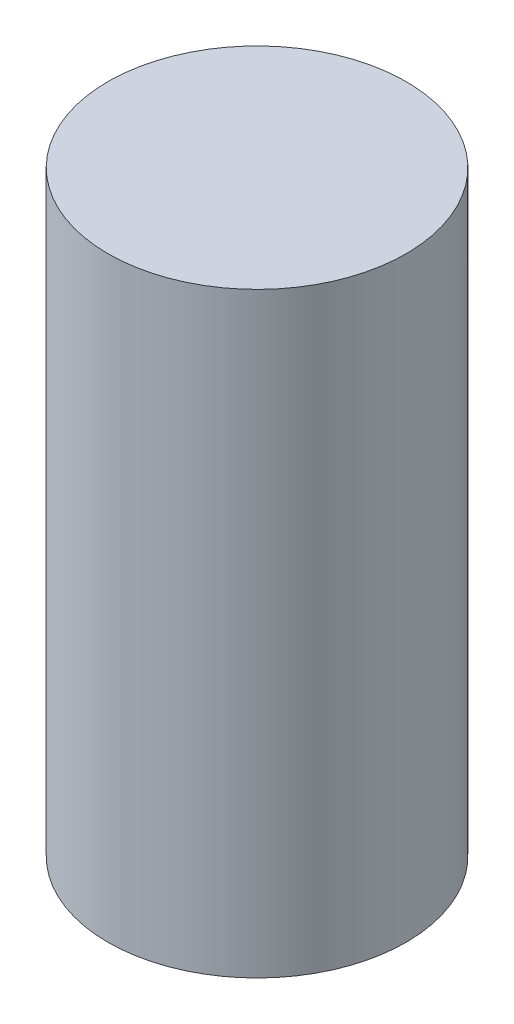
from build123d import *

# Parameters (mm, degrees)
EXTRUDE_L_NGD_DEPTH      = 10
EXTRUDE_L_NGD_DEPTH_BACK = 10
SKETCH1_R                = 5


with BuildPart() as part:
    # Sketch1 → Extrude l_ngd (new, two sides: drawn at the far end of the back side and taken through both)
    with BuildSketch(Plane(origin=(0, 0, 0), x_dir=(1, 0, 0), z_dir=(0, 1, 0)).offset(-EXTRUDE_L_NGD_DEPTH_BACK)):
        with Locations(Location((0, 0, 0), (0, 0, 270))):
            Circle(SKETCH1_R)
    extrude(amount=EXTRUDE_L_NGD_DEPTH + EXTRUDE_L_NGD_DEPTH_BACK)


solid = part.part
